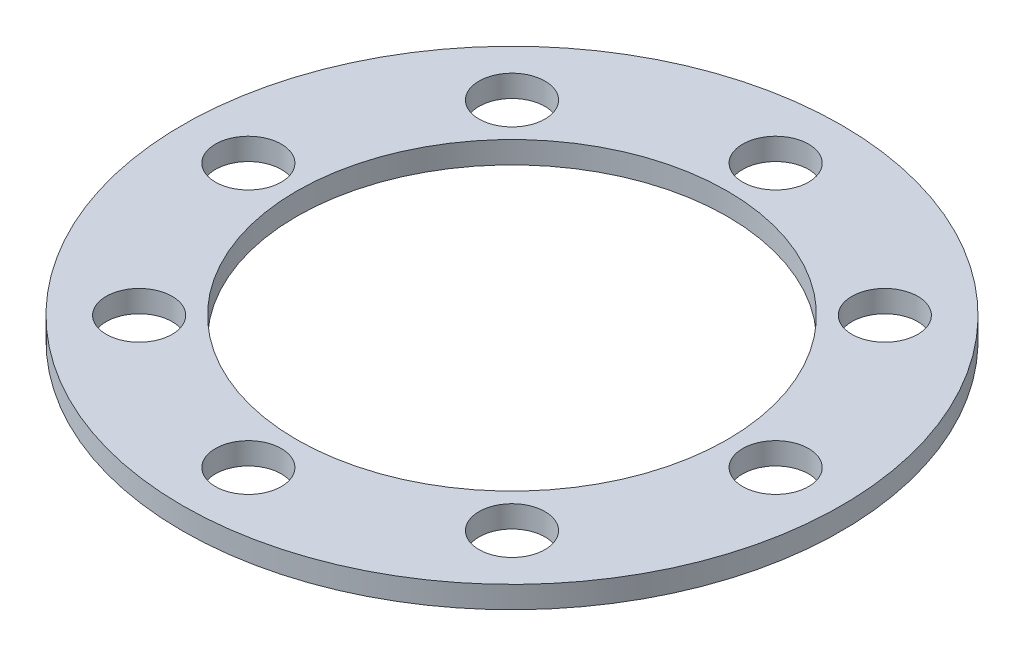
ISO-10303-21;
HEADER;
FILE_DESCRIPTION(('STEP AP214'),'2;1');
FILE_NAME('part.step','',(''),(''),'','','');
FILE_SCHEMA(('AUTOMOTIVE_DESIGN { 1 0 10303 214 1 1 1 1 }'));
ENDSEC;
DATA;
#1=APPLICATION_CONTEXT('core data for automotive mechanical design processes');
#2=APPLICATION_PROTOCOL_DEFINITION('international standard','automotive_design',2000,#1);
#3=PRODUCT_CONTEXT('',#1,'mechanical');
#4=PRODUCT('Part','Part','',(#3));
#5=PRODUCT_RELATED_PRODUCT_CATEGORY('part','',(#4));
#6=PRODUCT_DEFINITION_FORMATION('','',#4);
#7=PRODUCT_DEFINITION_CONTEXT('part definition',#1,'design');
#8=PRODUCT_DEFINITION('design','',#6,#7);
#9=PRODUCT_DEFINITION_SHAPE('','',#8);
#10=(LENGTH_UNIT() NAMED_UNIT(*) SI_UNIT(.MILLI.,.METRE.));
#11=(NAMED_UNIT(*) PLANE_ANGLE_UNIT() SI_UNIT($,.RADIAN.));
#12=(NAMED_UNIT(*) SI_UNIT($,.STERADIAN.) SOLID_ANGLE_UNIT());
#13=UNCERTAINTY_MEASURE_WITH_UNIT(LENGTH_MEASURE(1.E-05),#10,'distance_accuracy_value','');
#14=(GEOMETRIC_REPRESENTATION_CONTEXT(3) GLOBAL_UNCERTAINTY_ASSIGNED_CONTEXT((#13)) GLOBAL_UNIT_ASSIGNED_CONTEXT((#10,
#11,#12)) REPRESENTATION_CONTEXT('',''));
#15=CARTESIAN_POINT('',(0.,0.,0.));
#16=DIRECTION('',(0.,0.,1.));
#17=DIRECTION('',(1.,0.,0.));
#18=AXIS2_PLACEMENT_3D('',#15,#16,#17);
#19=CARTESIAN_POINT('',(0.,3.175,0.));
#20=DIRECTION('',(0.,-1.,0.));
#21=DIRECTION('',(0.,0.,-1.));
#22=AXIS2_PLACEMENT_3D('',#19,#20,#21);
#23=CYLINDRICAL_SURFACE('',#22,31.115);
#24=CARTESIAN_POINT('',(0.,3.175,0.));
#25=DIRECTION('',(0.,1.,0.));
#26=DIRECTION('',(0.,0.,1.));
#27=AXIS2_PLACEMENT_3D('',#24,#25,#26);
#28=CIRCLE('',#27,31.115);
#29=CARTESIAN_POINT('',(0.,3.175,31.115));
#30=VERTEX_POINT('',#29);
#31=EDGE_CURVE('E52',#30,#30,#28,.T.);
#32=ORIENTED_EDGE('',*,*,#31,.T.);
#33=EDGE_LOOP('',(#32));
#34=FACE_BOUND('',#33,.T.);
#35=CARTESIAN_POINT('',(0.,0.,0.));
#36=DIRECTION('',(0.,1.,0.));
#37=DIRECTION('',(0.,0.,1.));
#38=AXIS2_PLACEMENT_3D('',#35,#36,#37);
#39=CIRCLE('',#38,31.115);
#40=CARTESIAN_POINT('',(0.,0.,31.115));
#41=VERTEX_POINT('',#40);
#42=EDGE_CURVE('E93',#41,#41,#39,.T.);
#43=ORIENTED_EDGE('',*,*,#42,.F.);
#44=EDGE_LOOP('',(#43));
#45=FACE_BOUND('',#44,.T.);
#46=ADVANCED_FACE('F43',(#34,#45),#23,.F.);
#47=CARTESIAN_POINT('',(-26.940768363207,3.175,-26.9407683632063));
#48=DIRECTION('',(0.,-1.,0.));
#49=DIRECTION('',(0.,0.,-1.));
#50=AXIS2_PLACEMENT_3D('',#47,#48,#49);
#51=CYLINDRICAL_SURFACE('',#50,4.76250000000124);
#52=CARTESIAN_POINT('',(-26.940768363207,3.175,-26.9407683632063));
#53=DIRECTION('',(0.,1.,0.));
#54=DIRECTION('',(0.,0.,1.));
#55=AXIS2_PLACEMENT_3D('',#52,#53,#54);
#56=CIRCLE('',#55,4.76250000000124);
#57=CARTESIAN_POINT('',(-26.940768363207,3.175,-22.1782683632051));
#58=VERTEX_POINT('',#57);
#59=EDGE_CURVE('E58',#58,#58,#56,.T.);
#60=ORIENTED_EDGE('',*,*,#59,.T.);
#61=EDGE_LOOP('',(#60));
#62=FACE_BOUND('',#61,.T.);
#63=CARTESIAN_POINT('',(-26.940768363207,0.,-26.9407683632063));
#64=DIRECTION('',(0.,1.,0.));
#65=DIRECTION('',(0.,0.,1.));
#66=AXIS2_PLACEMENT_3D('',#63,#64,#65);
#67=CIRCLE('',#66,4.76250000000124);
#68=CARTESIAN_POINT('',(-26.940768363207,0.,-22.1782683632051));
#69=VERTEX_POINT('',#68);
#70=EDGE_CURVE('E90',#69,#69,#67,.T.);
#71=ORIENTED_EDGE('',*,*,#70,.F.);
#72=EDGE_LOOP('',(#71));
#73=FACE_BOUND('',#72,.T.);
#74=ADVANCED_FACE('F136',(#62,#73),#51,.F.);
#75=CARTESIAN_POINT('',(0.,3.175,-38.1));
#76=DIRECTION('',(0.,-1.,0.));
#77=DIRECTION('',(0.,0.,-1.));
#78=AXIS2_PLACEMENT_3D('',#75,#76,#77);
#79=CYLINDRICAL_SURFACE('',#78,4.7625);
#80=CARTESIAN_POINT('',(0.,3.175,-38.1));
#81=DIRECTION('',(0.,1.,0.));
#82=DIRECTION('',(0.,0.,1.));
#83=AXIS2_PLACEMENT_3D('',#80,#81,#82);
#84=CIRCLE('',#83,4.7625);
#85=CARTESIAN_POINT('',(0.,3.175,-33.3375));
#86=VERTEX_POINT('',#85);
#87=EDGE_CURVE('E129',#86,#86,#84,.T.);
#88=ORIENTED_EDGE('',*,*,#87,.T.);
#89=EDGE_LOOP('',(#88));
#90=FACE_BOUND('',#89,.T.);
#91=CARTESIAN_POINT('',(0.,0.,-38.1));
#92=DIRECTION('',(0.,1.,0.));
#93=DIRECTION('',(0.,0.,1.));
#94=AXIS2_PLACEMENT_3D('',#91,#92,#93);
#95=CIRCLE('',#94,4.7625);
#96=CARTESIAN_POINT('',(0.,0.,-33.3375));
#97=VERTEX_POINT('',#96);
#98=EDGE_CURVE('E86',#97,#97,#95,.T.);
#99=ORIENTED_EDGE('',*,*,#98,.F.);
#100=EDGE_LOOP('',(#99));
#101=FACE_BOUND('',#100,.T.);
#102=ADVANCED_FACE('F154',(#90,#101),#79,.F.);
#103=CARTESIAN_POINT('',(26.9407683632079,3.175,-26.9407683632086));
#104=DIRECTION('',(0.,-1.,0.));
#105=DIRECTION('',(0.,0.,-1.));
#106=AXIS2_PLACEMENT_3D('',#103,#104,#105);
#107=CYLINDRICAL_SURFACE('',#106,4.76250000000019);
#108=CARTESIAN_POINT('',(26.9407683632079,3.175,-26.9407683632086));
#109=DIRECTION('',(0.,1.,0.));
#110=DIRECTION('',(0.,0.,1.));
#111=AXIS2_PLACEMENT_3D('',#108,#109,#110);
#112=CIRCLE('',#111,4.76250000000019);
#113=CARTESIAN_POINT('',(26.9407683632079,3.175,-22.1782683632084));
#114=VERTEX_POINT('',#113);
#115=EDGE_CURVE('E125',#114,#114,#112,.T.);
#116=ORIENTED_EDGE('',*,*,#115,.T.);
#117=EDGE_LOOP('',(#116));
#118=FACE_BOUND('',#117,.T.);
#119=CARTESIAN_POINT('',(26.9407683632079,0.,-26.9407683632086));
#120=DIRECTION('',(0.,1.,0.));
#121=DIRECTION('',(0.,0.,1.));
#122=AXIS2_PLACEMENT_3D('',#119,#120,#121);
#123=CIRCLE('',#122,4.76250000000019);
#124=CARTESIAN_POINT('',(26.9407683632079,0.,-22.1782683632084));
#125=VERTEX_POINT('',#124);
#126=EDGE_CURVE('E82',#125,#125,#123,.T.);
#127=ORIENTED_EDGE('',*,*,#126,.F.);
#128=EDGE_LOOP('',(#127));
#129=FACE_BOUND('',#128,.T.);
#130=ADVANCED_FACE('F161',(#118,#129),#107,.F.);
#131=CARTESIAN_POINT('',(38.1000000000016,3.175,-1.61730183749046E-12));
#132=DIRECTION('',(0.,-1.,0.));
#133=DIRECTION('',(0.,0.,-1.));
#134=AXIS2_PLACEMENT_3D('',#131,#132,#133);
#135=CYLINDRICAL_SURFACE('',#134,4.7625000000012);
#136=CARTESIAN_POINT('',(38.1000000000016,3.175,-1.61730183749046E-12));
#137=DIRECTION('',(0.,1.,0.));
#138=DIRECTION('',(0.,0.,1.));
#139=AXIS2_PLACEMENT_3D('',#136,#137,#138);
#140=CIRCLE('',#139,4.7625000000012);
#141=CARTESIAN_POINT('',(38.1000000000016,3.175,4.76249999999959));
#142=VERTEX_POINT('',#141);
#143=EDGE_CURVE('E121',#142,#142,#140,.T.);
#144=ORIENTED_EDGE('',*,*,#143,.T.);
#145=EDGE_LOOP('',(#144));
#146=FACE_BOUND('',#145,.T.);
#147=CARTESIAN_POINT('',(38.1000000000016,0.,-1.61730183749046E-12));
#148=DIRECTION('',(0.,1.,0.));
#149=DIRECTION('',(0.,0.,1.));
#150=AXIS2_PLACEMENT_3D('',#147,#148,#149);
#151=CIRCLE('',#150,4.7625000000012);
#152=CARTESIAN_POINT('',(38.1000000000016,0.,4.76249999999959));
#153=VERTEX_POINT('',#152);
#154=EDGE_CURVE('E78',#153,#153,#151,.T.);
#155=ORIENTED_EDGE('',*,*,#154,.F.);
#156=EDGE_LOOP('',(#155));
#157=FACE_BOUND('',#156,.T.);
#158=ADVANCED_FACE('F165',(#146,#157),#135,.F.);
#159=CARTESIAN_POINT('',(26.9407683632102,3.175,26.9407683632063));
#160=DIRECTION('',(0.,-1.,0.));
#161=DIRECTION('',(0.,0.,-1.));
#162=AXIS2_PLACEMENT_3D('',#159,#160,#161);
#163=CYLINDRICAL_SURFACE('',#162,4.7625000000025);
#164=CARTESIAN_POINT('',(26.9407683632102,3.175,26.9407683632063));
#165=DIRECTION('',(0.,1.,0.));
#166=DIRECTION('',(0.,0.,1.));
#167=AXIS2_PLACEMENT_3D('',#164,#165,#166);
#168=CIRCLE('',#167,4.7625000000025);
#169=CARTESIAN_POINT('',(26.9407683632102,3.175,31.7032683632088));
#170=VERTEX_POINT('',#169);
#171=EDGE_CURVE('E117',#170,#170,#168,.T.);
#172=ORIENTED_EDGE('',*,*,#171,.T.);
#173=EDGE_LOOP('',(#172));
#174=FACE_BOUND('',#173,.T.);
#175=CARTESIAN_POINT('',(26.9407683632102,0.,26.9407683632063));
#176=DIRECTION('',(0.,1.,0.));
#177=DIRECTION('',(0.,0.,1.));
#178=AXIS2_PLACEMENT_3D('',#175,#176,#177);
#179=CIRCLE('',#178,4.7625000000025);
#180=CARTESIAN_POINT('',(26.9407683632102,0.,31.7032683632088));
#181=VERTEX_POINT('',#180);
#182=EDGE_CURVE('E74',#181,#181,#179,.T.);
#183=ORIENTED_EDGE('',*,*,#182,.F.);
#184=EDGE_LOOP('',(#183));
#185=FACE_BOUND('',#184,.T.);
#186=ADVANCED_FACE('F169',(#174,#185),#163,.F.);
#187=CARTESIAN_POINT('',(3.23460367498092E-12,3.175,38.1));
#188=DIRECTION('',(0.,-1.,0.));
#189=DIRECTION('',(0.,0.,-1.));
#190=AXIS2_PLACEMENT_3D('',#187,#188,#189);
#191=CYLINDRICAL_SURFACE('',#190,4.76250000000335);
#192=CARTESIAN_POINT('',(3.23460367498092E-12,3.175,38.1));
#193=DIRECTION('',(0.,1.,0.));
#194=DIRECTION('',(0.,0.,1.));
#195=AXIS2_PLACEMENT_3D('',#192,#193,#194);
#196=CIRCLE('',#195,4.76250000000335);
#197=CARTESIAN_POINT('',(3.23460367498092E-12,3.175,42.8625000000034));
#198=VERTEX_POINT('',#197);
#199=EDGE_CURVE('E111',#198,#198,#196,.T.);
#200=ORIENTED_EDGE('',*,*,#199,.T.);
#201=EDGE_LOOP('',(#200));
#202=FACE_BOUND('',#201,.T.);
#203=CARTESIAN_POINT('',(3.23460367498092E-12,0.,38.1));
#204=DIRECTION('',(0.,1.,0.));
#205=DIRECTION('',(0.,0.,1.));
#206=AXIS2_PLACEMENT_3D('',#203,#204,#205);
#207=CIRCLE('',#206,4.76250000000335);
#208=CARTESIAN_POINT('',(3.23460367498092E-12,0.,42.8625000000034));
#209=VERTEX_POINT('',#208);
#210=EDGE_CURVE('E70',#209,#209,#207,.T.);
#211=ORIENTED_EDGE('',*,*,#210,.F.);
#212=EDGE_LOOP('',(#211));
#213=FACE_BOUND('',#212,.T.);
#214=ADVANCED_FACE('F173',(#202,#213),#191,.F.);
#215=CARTESIAN_POINT('',(-26.9407683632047,3.175,26.9407683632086));
#216=DIRECTION('',(0.,-1.,0.));
#217=DIRECTION('',(0.,0.,-1.));
#218=AXIS2_PLACEMENT_3D('',#215,#216,#217);
#219=CYLINDRICAL_SURFACE('',#218,4.76250000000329);
#220=CARTESIAN_POINT('',(-26.9407683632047,3.175,26.9407683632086));
#221=DIRECTION('',(0.,1.,0.));
#222=DIRECTION('',(0.,0.,1.));
#223=AXIS2_PLACEMENT_3D('',#220,#221,#222);
#224=CIRCLE('',#223,4.76250000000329);
#225=CARTESIAN_POINT('',(-26.9407683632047,3.175,31.7032683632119));
#226=VERTEX_POINT('',#225);
#227=EDGE_CURVE('E105',#226,#226,#224,.T.);
#228=ORIENTED_EDGE('',*,*,#227,.T.);
#229=EDGE_LOOP('',(#228));
#230=FACE_BOUND('',#229,.T.);
#231=CARTESIAN_POINT('',(-26.9407683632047,0.,26.9407683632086));
#232=DIRECTION('',(0.,1.,0.));
#233=DIRECTION('',(0.,0.,1.));
#234=AXIS2_PLACEMENT_3D('',#231,#232,#233);
#235=CIRCLE('',#234,4.76250000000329);
#236=CARTESIAN_POINT('',(-26.9407683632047,0.,31.7032683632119));
#237=VERTEX_POINT('',#236);
#238=EDGE_CURVE('E66',#237,#237,#235,.T.);
#239=ORIENTED_EDGE('',*,*,#238,.F.);
#240=EDGE_LOOP('',(#239));
#241=FACE_BOUND('',#240,.T.);
#242=ADVANCED_FACE('F176',(#230,#241),#219,.F.);
#243=CARTESIAN_POINT('',(-38.0999999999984,3.175,1.62196774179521E-12));
#244=DIRECTION('',(0.,-1.,0.));
#245=DIRECTION('',(0.,0.,-1.));
#246=AXIS2_PLACEMENT_3D('',#243,#244,#245);
#247=CYLINDRICAL_SURFACE('',#246,4.76250000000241);
#248=CARTESIAN_POINT('',(-38.0999999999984,3.175,1.62196774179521E-12));
#249=DIRECTION('',(0.,1.,0.));
#250=DIRECTION('',(0.,0.,1.));
#251=AXIS2_PLACEMENT_3D('',#248,#249,#250);
#252=CIRCLE('',#251,4.76250000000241);
#253=CARTESIAN_POINT('',(-38.0999999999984,3.175,4.76250000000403));
#254=VERTEX_POINT('',#253);
#255=EDGE_CURVE('E100',#254,#254,#252,.T.);
#256=ORIENTED_EDGE('',*,*,#255,.T.);
#257=EDGE_LOOP('',(#256));
#258=FACE_BOUND('',#257,.T.);
#259=CARTESIAN_POINT('',(-38.0999999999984,0.,1.62196774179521E-12));
#260=DIRECTION('',(0.,1.,0.));
#261=DIRECTION('',(0.,0.,1.));
#262=AXIS2_PLACEMENT_3D('',#259,#260,#261);
#263=CIRCLE('',#262,4.76250000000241);
#264=CARTESIAN_POINT('',(-38.0999999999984,0.,4.76250000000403));
#265=VERTEX_POINT('',#264);
#266=EDGE_CURVE('E62',#265,#265,#263,.T.);
#267=ORIENTED_EDGE('',*,*,#266,.F.);
#268=EDGE_LOOP('',(#267));
#269=FACE_BOUND('',#268,.T.);
#270=ADVANCED_FACE('F45',(#258,#269),#247,.F.);
#271=CARTESIAN_POINT('',(0.,3.175,0.));
#272=DIRECTION('',(0.,-1.,0.));
#273=DIRECTION('',(0.,0.,-1.));
#274=AXIS2_PLACEMENT_3D('',#271,#272,#273);
#275=CYLINDRICAL_SURFACE('',#274,47.625);
#276=CARTESIAN_POINT('',(0.,3.175,0.));
#277=DIRECTION('',(0.,1.,0.));
#278=DIRECTION('',(0.,0.,1.));
#279=AXIS2_PLACEMENT_3D('',#276,#277,#278);
#280=CIRCLE('',#279,47.625);
#281=CARTESIAN_POINT('',(0.,3.175,47.625));
#282=VERTEX_POINT('',#281);
#283=EDGE_CURVE('E10',#282,#282,#280,.T.);
#284=ORIENTED_EDGE('',*,*,#283,.F.);
#285=EDGE_LOOP('',(#284));
#286=FACE_BOUND('',#285,.T.);
#287=CARTESIAN_POINT('',(0.,0.,0.));
#288=DIRECTION('',(0.,1.,0.));
#289=DIRECTION('',(0.,0.,1.));
#290=AXIS2_PLACEMENT_3D('',#287,#288,#289);
#291=CIRCLE('',#290,47.625);
#292=CARTESIAN_POINT('',(0.,0.,47.625));
#293=VERTEX_POINT('',#292);
#294=EDGE_CURVE('E47',#293,#293,#291,.T.);
#295=ORIENTED_EDGE('',*,*,#294,.T.);
#296=EDGE_LOOP('',(#295));
#297=FACE_BOUND('',#296,.T.);
#298=ADVANCED_FACE('F143',(#286,#297),#275,.T.);
#299=CARTESIAN_POINT('',(0.,3.175,0.));
#300=DIRECTION('',(0.,1.,0.));
#301=DIRECTION('',(0.,0.,1.));
#302=AXIS2_PLACEMENT_3D('',#299,#300,#301);
#303=PLANE('',#302);
#304=ORIENTED_EDGE('',*,*,#255,.F.);
#305=EDGE_LOOP('',(#304));
#306=FACE_BOUND('',#305,.T.);
#307=ORIENTED_EDGE('',*,*,#227,.F.);
#308=EDGE_LOOP('',(#307));
#309=FACE_BOUND('',#308,.T.);
#310=ORIENTED_EDGE('',*,*,#199,.F.);
#311=EDGE_LOOP('',(#310));
#312=FACE_BOUND('',#311,.T.);
#313=ORIENTED_EDGE('',*,*,#171,.F.);
#314=EDGE_LOOP('',(#313));
#315=FACE_BOUND('',#314,.T.);
#316=ORIENTED_EDGE('',*,*,#143,.F.);
#317=EDGE_LOOP('',(#316));
#318=FACE_BOUND('',#317,.T.);
#319=ORIENTED_EDGE('',*,*,#115,.F.);
#320=EDGE_LOOP('',(#319));
#321=FACE_BOUND('',#320,.T.);
#322=ORIENTED_EDGE('',*,*,#87,.F.);
#323=EDGE_LOOP('',(#322));
#324=FACE_BOUND('',#323,.T.);
#325=ORIENTED_EDGE('',*,*,#59,.F.);
#326=EDGE_LOOP('',(#325));
#327=FACE_BOUND('',#326,.T.);
#328=ORIENTED_EDGE('',*,*,#31,.F.);
#329=EDGE_LOOP('',(#328));
#330=FACE_BOUND('',#329,.T.);
#331=ORIENTED_EDGE('',*,*,#283,.T.);
#332=EDGE_LOOP('',(#331));
#333=FACE_BOUND('',#332,.T.);
#334=ADVANCED_FACE('F139',(#306,#309,#312,#315,#318,#321,#324,#327,#330,#333),#303,.T.);
#335=CARTESIAN_POINT('',(0.,0.,0.));
#336=DIRECTION('',(0.,1.,0.));
#337=DIRECTION('',(0.,0.,1.));
#338=AXIS2_PLACEMENT_3D('',#335,#336,#337);
#339=PLANE('',#338);
#340=ORIENTED_EDGE('',*,*,#266,.T.);
#341=EDGE_LOOP('',(#340));
#342=FACE_BOUND('',#341,.T.);
#343=ORIENTED_EDGE('',*,*,#238,.T.);
#344=EDGE_LOOP('',(#343));
#345=FACE_BOUND('',#344,.T.);
#346=ORIENTED_EDGE('',*,*,#210,.T.);
#347=EDGE_LOOP('',(#346));
#348=FACE_BOUND('',#347,.T.);
#349=ORIENTED_EDGE('',*,*,#182,.T.);
#350=EDGE_LOOP('',(#349));
#351=FACE_BOUND('',#350,.T.);
#352=ORIENTED_EDGE('',*,*,#154,.T.);
#353=EDGE_LOOP('',(#352));
#354=FACE_BOUND('',#353,.T.);
#355=ORIENTED_EDGE('',*,*,#126,.T.);
#356=EDGE_LOOP('',(#355));
#357=FACE_BOUND('',#356,.T.);
#358=ORIENTED_EDGE('',*,*,#98,.T.);
#359=EDGE_LOOP('',(#358));
#360=FACE_BOUND('',#359,.T.);
#361=ORIENTED_EDGE('',*,*,#70,.T.);
#362=EDGE_LOOP('',(#361));
#363=FACE_BOUND('',#362,.T.);
#364=ORIENTED_EDGE('',*,*,#42,.T.);
#365=EDGE_LOOP('',(#364));
#366=FACE_BOUND('',#365,.T.);
#367=ORIENTED_EDGE('',*,*,#294,.F.);
#368=EDGE_LOOP('',(#367));
#369=FACE_BOUND('',#368,.T.);
#370=ADVANCED_FACE('F142',(#342,#345,#348,#351,#354,#357,#360,#363,#366,#369),#339,.F.);
#371=CLOSED_SHELL('',(#46,#74,#102,#130,#158,#186,#214,#242,#270,#298,#334,#370));
#372=MANIFOLD_SOLID_BREP('B2',#371);
#373=ADVANCED_BREP_SHAPE_REPRESENTATION('',(#18,#372),#14);
#374=SHAPE_DEFINITION_REPRESENTATION(#9,#373);
ENDSEC;
END-ISO-10303-21;
